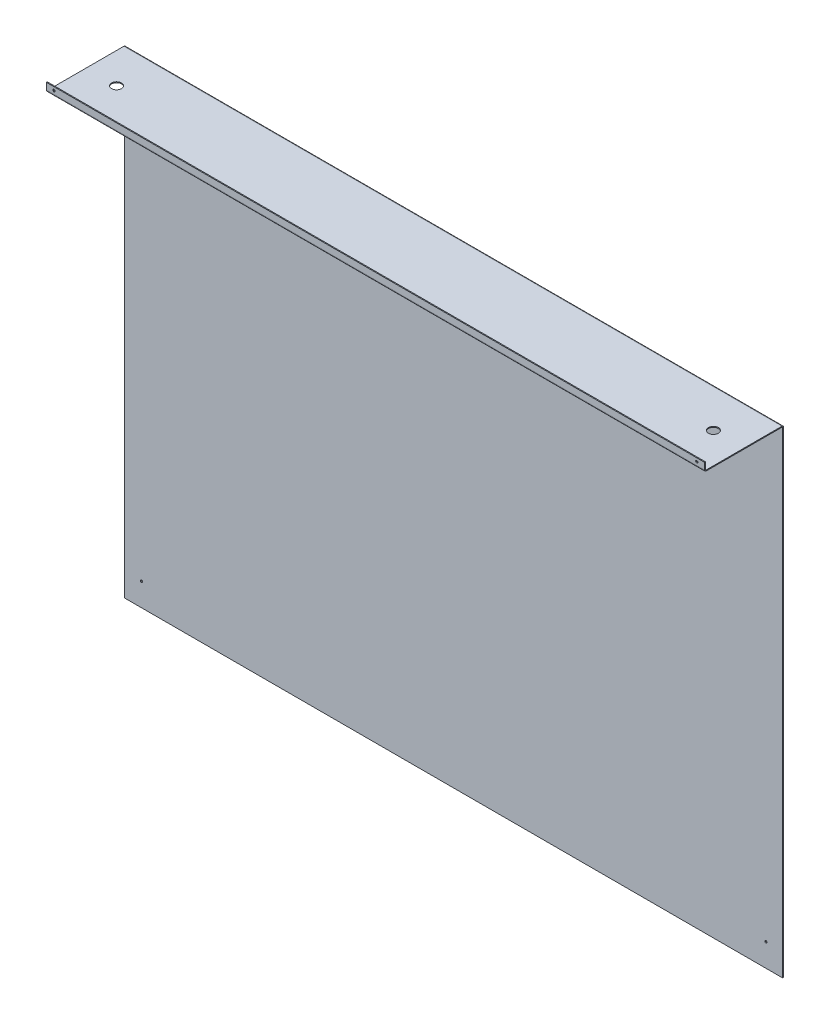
ISO-10303-21;
HEADER;
FILE_DESCRIPTION(('STEP AP214'),'2;1');
FILE_NAME('part.step','',(''),(''),'','','');
FILE_SCHEMA(('AUTOMOTIVE_DESIGN { 1 0 10303 214 1 1 1 1 }'));
ENDSEC;
DATA;
#1=APPLICATION_CONTEXT('core data for automotive mechanical design processes');
#2=APPLICATION_PROTOCOL_DEFINITION('international standard','automotive_design',2000,#1);
#3=PRODUCT_CONTEXT('',#1,'mechanical');
#4=PRODUCT('Part','Part','',(#3));
#5=PRODUCT_RELATED_PRODUCT_CATEGORY('part','',(#4));
#6=PRODUCT_DEFINITION_FORMATION('','',#4);
#7=PRODUCT_DEFINITION_CONTEXT('part definition',#1,'design');
#8=PRODUCT_DEFINITION('design','',#6,#7);
#9=PRODUCT_DEFINITION_SHAPE('','',#8);
#10=(LENGTH_UNIT() NAMED_UNIT(*) SI_UNIT(.MILLI.,.METRE.));
#11=(NAMED_UNIT(*) PLANE_ANGLE_UNIT() SI_UNIT($,.RADIAN.));
#12=(NAMED_UNIT(*) SI_UNIT($,.STERADIAN.) SOLID_ANGLE_UNIT());
#13=UNCERTAINTY_MEASURE_WITH_UNIT(LENGTH_MEASURE(1.E-05),#10,'distance_accuracy_value','');
#14=(GEOMETRIC_REPRESENTATION_CONTEXT(3) GLOBAL_UNCERTAINTY_ASSIGNED_CONTEXT((#13)) GLOBAL_UNIT_ASSIGNED_CONTEXT((#10,
#11,#12)) REPRESENTATION_CONTEXT('',''));
#15=CARTESIAN_POINT('',(0.,0.,0.));
#16=DIRECTION('',(0.,0.,1.));
#17=DIRECTION('',(1.,0.,0.));
#18=AXIS2_PLACEMENT_3D('',#15,#16,#17);
#19=CARTESIAN_POINT('',(430.,275.7,103.5));
#20=DIRECTION('',(1.,0.,0.));
#21=DIRECTION('',(0.,0.,-1.));
#22=AXIS2_PLACEMENT_3D('',#19,#20,#21);
#23=PLANE('',#22);
#24=DIRECTION('',(0.,0.,1.));
#25=VECTOR('',#24,1.);
#26=CARTESIAN_POINT('',(430.,275.7,103.5));
#27=LINE('',#26,#25);
#28=CARTESIAN_POINT('',(430.,275.7,2.19999999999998));
#29=VERTEX_POINT('',#28);
#30=CARTESIAN_POINT('',(430.,275.7,101.3));
#31=VERTEX_POINT('',#30);
#32=EDGE_CURVE('E233',#29,#31,#27,.T.);
#33=ORIENTED_EDGE('',*,*,#32,.T.);
#34=DIRECTION('',(0.,-1.,0.));
#35=VECTOR('',#34,1.);
#36=CARTESIAN_POINT('',(430.,275.7,101.3));
#37=LINE('',#36,#35);
#38=CARTESIAN_POINT('',(430.,274.5,101.3));
#39=VERTEX_POINT('',#38);
#40=EDGE_CURVE('E217',#31,#39,#37,.T.);
#41=ORIENTED_EDGE('',*,*,#40,.T.);
#42=DIRECTION('',(0.,0.,-1.));
#43=VECTOR('',#42,1.);
#44=CARTESIAN_POINT('',(430.,274.5,-1.9762620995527E-13));
#45=LINE('',#44,#43);
#46=CARTESIAN_POINT('',(430.,274.5,2.19999999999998));
#47=VERTEX_POINT('',#46);
#48=EDGE_CURVE('E237',#47,#39,#45,.F.);
#49=ORIENTED_EDGE('',*,*,#48,.F.);
#50=DIRECTION('',(0.,1.,0.));
#51=VECTOR('',#50,1.);
#52=CARTESIAN_POINT('',(430.,275.7,2.19999999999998));
#53=LINE('',#52,#51);
#54=EDGE_CURVE('E228',#47,#29,#53,.T.);
#55=ORIENTED_EDGE('',*,*,#54,.T.);
#56=EDGE_LOOP('',(#33,#41,#49,#55));
#57=FACE_BOUND('',#56,.T.);
#58=ADVANCED_FACE('F77',(#57),#23,.T.);
#59=CARTESIAN_POINT('',(0.,275.7,-9.01809976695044E-13));
#60=DIRECTION('',(0.,1.,0.));
#61=DIRECTION('',(0.,0.,1.));
#62=AXIS2_PLACEMENT_3D('',#59,#60,#61);
#63=PLANE('',#62);
#64=CARTESIAN_POINT('',(390.,275.7,51.7499999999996));
#65=DIRECTION('',(0.,1.,0.));
#66=DIRECTION('',(0.,0.,1.));
#67=AXIS2_PLACEMENT_3D('',#64,#65,#66);
#68=CIRCLE('',#67,6.50000000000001);
#69=CARTESIAN_POINT('',(390.,275.7,58.2499999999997));
#70=VERTEX_POINT('',#69);
#71=EDGE_CURVE('E438',#70,#70,#68,.T.);
#72=ORIENTED_EDGE('',*,*,#71,.F.);
#73=EDGE_LOOP('',(#72));
#74=FACE_BOUND('',#73,.T.);
#75=CARTESIAN_POINT('',(-390.,275.7,51.7499999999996));
#76=DIRECTION('',(0.,1.,0.));
#77=DIRECTION('',(0.,0.,1.));
#78=AXIS2_PLACEMENT_3D('',#75,#76,#77);
#79=CIRCLE('',#78,6.50000000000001);
#80=CARTESIAN_POINT('',(-390.,275.7,58.2499999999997));
#81=VERTEX_POINT('',#80);
#82=EDGE_CURVE('E424',#81,#81,#79,.T.);
#83=ORIENTED_EDGE('',*,*,#82,.F.);
#84=EDGE_LOOP('',(#83));
#85=FACE_BOUND('',#84,.T.);
#86=DIRECTION('',(0.,0.,-1.));
#87=VECTOR('',#86,1.);
#88=CARTESIAN_POINT('',(-430.,275.7,1.2));
#89=LINE('',#88,#87);
#90=CARTESIAN_POINT('',(-430.,275.7,101.3));
#91=VERTEX_POINT('',#90);
#92=CARTESIAN_POINT('',(-430.,275.7,2.19999999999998));
#93=VERTEX_POINT('',#92);
#94=EDGE_CURVE('E230',#91,#93,#89,.T.);
#95=ORIENTED_EDGE('',*,*,#94,.F.);
#96=DIRECTION('',(1.,0.,0.));
#97=VECTOR('',#96,1.);
#98=CARTESIAN_POINT('',(430.,275.7,101.3));
#99=LINE('',#98,#97);
#100=EDGE_CURVE('E99',#31,#91,#99,.F.);
#101=ORIENTED_EDGE('',*,*,#100,.F.);
#102=ORIENTED_EDGE('',*,*,#32,.F.);
#103=DIRECTION('',(-1.,0.,0.));
#104=VECTOR('',#103,1.);
#105=CARTESIAN_POINT('',(0.,275.7,2.19999999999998));
#106=LINE('',#105,#104);
#107=EDGE_CURVE('E240',#29,#93,#106,.T.);
#108=ORIENTED_EDGE('',*,*,#107,.T.);
#109=EDGE_LOOP('',(#95,#101,#102,#108));
#110=FACE_BOUND('',#109,.T.);
#111=ADVANCED_FACE('F325',(#74,#85,#110),#63,.T.);
#112=CARTESIAN_POINT('',(0.,274.5,-8.97620199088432E-13));
#113=DIRECTION('',(0.,1.,0.));
#114=DIRECTION('',(0.,0.,1.));
#115=AXIS2_PLACEMENT_3D('',#112,#113,#114);
#116=PLANE('',#115);
#117=CARTESIAN_POINT('',(390.,274.5,51.7499999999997));
#118=DIRECTION('',(0.,1.,0.));
#119=DIRECTION('',(0.,0.,1.));
#120=AXIS2_PLACEMENT_3D('',#117,#118,#119);
#121=CIRCLE('',#120,6.50000000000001);
#122=CARTESIAN_POINT('',(390.,274.5,58.2499999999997));
#123=VERTEX_POINT('',#122);
#124=EDGE_CURVE('E435',#123,#123,#121,.T.);
#125=ORIENTED_EDGE('',*,*,#124,.T.);
#126=EDGE_LOOP('',(#125));
#127=FACE_BOUND('',#126,.T.);
#128=CARTESIAN_POINT('',(-390.,274.5,51.7499999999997));
#129=DIRECTION('',(0.,1.,0.));
#130=DIRECTION('',(0.,0.,1.));
#131=AXIS2_PLACEMENT_3D('',#128,#129,#130);
#132=CIRCLE('',#131,6.50000000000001);
#133=CARTESIAN_POINT('',(-390.,274.5,58.2499999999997));
#134=VERTEX_POINT('',#133);
#135=EDGE_CURVE('E428',#134,#134,#132,.T.);
#136=ORIENTED_EDGE('',*,*,#135,.T.);
#137=EDGE_LOOP('',(#136));
#138=FACE_BOUND('',#137,.T.);
#139=DIRECTION('',(1.,0.,0.));
#140=VECTOR('',#139,1.);
#141=CARTESIAN_POINT('',(430.,274.5,101.3));
#142=LINE('',#141,#140);
#143=CARTESIAN_POINT('',(-430.,274.5,101.3));
#144=VERTEX_POINT('',#143);
#145=EDGE_CURVE('E211',#39,#144,#142,.F.);
#146=ORIENTED_EDGE('',*,*,#145,.T.);
#147=DIRECTION('',(0.,0.,1.));
#148=VECTOR('',#147,1.);
#149=CARTESIAN_POINT('',(-430.,274.5,-1.83094551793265E-12));
#150=LINE('',#149,#148);
#151=CARTESIAN_POINT('',(-430.,274.5,2.19999999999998));
#152=VERTEX_POINT('',#151);
#153=EDGE_CURVE('E235',#144,#152,#150,.F.);
#154=ORIENTED_EDGE('',*,*,#153,.T.);
#155=DIRECTION('',(1.,0.,0.));
#156=VECTOR('',#155,1.);
#157=CARTESIAN_POINT('',(430.,274.5,2.19999999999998));
#158=LINE('',#157,#156);
#159=EDGE_CURVE('E246',#47,#152,#158,.F.);
#160=ORIENTED_EDGE('',*,*,#159,.F.);
#161=ORIENTED_EDGE('',*,*,#48,.T.);
#162=EDGE_LOOP('',(#146,#154,#160,#161));
#163=FACE_BOUND('',#162,.T.);
#164=ADVANCED_FACE('F331',(#127,#138,#163),#116,.F.);
#165=CARTESIAN_POINT('',(-430.,275.7,1.2));
#166=DIRECTION('',(1.,0.,0.));
#167=DIRECTION('',(0.,1.,0.));
#168=AXIS2_PLACEMENT_3D('',#165,#166,#167);
#169=PLANE('',#168);
#170=DIRECTION('',(0.,0.,-1.));
#171=VECTOR('',#170,1.);
#172=CARTESIAN_POINT('',(-430.,273.5,1.19999999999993));
#173=LINE('',#172,#171);
#174=CARTESIAN_POINT('',(-430.,273.5,1.19999999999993));
#175=VERTEX_POINT('',#174);
#176=CARTESIAN_POINT('',(-430.,273.5,0.));
#177=VERTEX_POINT('',#176);
#178=EDGE_CURVE('E258',#175,#177,#173,.T.);
#179=ORIENTED_EDGE('',*,*,#178,.T.);
#180=DIRECTION('',(0.,-1.,0.));
#181=VECTOR('',#180,1.);
#182=CARTESIAN_POINT('',(-430.,275.7,0.));
#183=LINE('',#182,#181);
#184=CARTESIAN_POINT('',(-430.,-349.300000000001,0.));
#185=VERTEX_POINT('',#184);
#186=EDGE_CURVE('E271',#177,#185,#183,.T.);
#187=ORIENTED_EDGE('',*,*,#186,.T.);
#188=DIRECTION('',(0.,0.,-1.));
#189=VECTOR('',#188,1.);
#190=CARTESIAN_POINT('',(-430.,-349.300000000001,1.2));
#191=LINE('',#190,#189);
#192=CARTESIAN_POINT('',(-430.,-349.300000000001,1.2));
#193=VERTEX_POINT('',#192);
#194=EDGE_CURVE('E13',#193,#185,#191,.T.);
#195=ORIENTED_EDGE('',*,*,#194,.F.);
#196=DIRECTION('',(0.,-1.,0.));
#197=VECTOR('',#196,1.);
#198=CARTESIAN_POINT('',(-430.,275.7,1.2));
#199=LINE('',#198,#197);
#200=EDGE_CURVE('E274',#175,#193,#199,.T.);
#201=ORIENTED_EDGE('',*,*,#200,.F.);
#202=EDGE_LOOP('',(#179,#187,#195,#201));
#203=FACE_BOUND('',#202,.T.);
#204=ADVANCED_FACE('F79',(#203),#169,.F.);
#205=CARTESIAN_POINT('',(430.,275.7,1.2));
#206=DIRECTION('',(-1.,0.,0.));
#207=DIRECTION('',(0.,-1.,0.));
#208=AXIS2_PLACEMENT_3D('',#205,#206,#207);
#209=PLANE('',#208);
#210=DIRECTION('',(0.,0.,-1.));
#211=VECTOR('',#210,1.);
#212=CARTESIAN_POINT('',(430.,273.5,1.19999999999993));
#213=LINE('',#212,#211);
#214=CARTESIAN_POINT('',(430.,273.5,1.19999999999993));
#215=VERTEX_POINT('',#214);
#216=CARTESIAN_POINT('',(430.,273.5,0.));
#217=VERTEX_POINT('',#216);
#218=EDGE_CURVE('E268',#215,#217,#213,.T.);
#219=ORIENTED_EDGE('',*,*,#218,.F.);
#220=DIRECTION('',(0.,1.,0.));
#221=VECTOR('',#220,1.);
#222=CARTESIAN_POINT('',(430.,275.7,1.2));
#223=LINE('',#222,#221);
#224=CARTESIAN_POINT('',(430.,-349.300000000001,1.2));
#225=VERTEX_POINT('',#224);
#226=EDGE_CURVE('E279',#225,#215,#223,.T.);
#227=ORIENTED_EDGE('',*,*,#226,.F.);
#228=DIRECTION('',(0.,0.,-1.));
#229=VECTOR('',#228,1.);
#230=CARTESIAN_POINT('',(430.,-349.300000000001,1.2));
#231=LINE('',#230,#229);
#232=CARTESIAN_POINT('',(430.,-349.300000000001,0.));
#233=VERTEX_POINT('',#232);
#234=EDGE_CURVE('E85',#225,#233,#231,.T.);
#235=ORIENTED_EDGE('',*,*,#234,.T.);
#236=DIRECTION('',(0.,1.,0.));
#237=VECTOR('',#236,1.);
#238=CARTESIAN_POINT('',(430.,275.7,0.));
#239=LINE('',#238,#237);
#240=EDGE_CURVE('E277',#233,#217,#239,.T.);
#241=ORIENTED_EDGE('',*,*,#240,.T.);
#242=EDGE_LOOP('',(#219,#227,#235,#241));
#243=FACE_BOUND('',#242,.T.);
#244=ADVANCED_FACE('F292',(#243),#209,.F.);
#245=CARTESIAN_POINT('',(0.,0.,1.2));
#246=DIRECTION('',(0.,0.,-1.));
#247=DIRECTION('',(-1.,0.,0.));
#248=AXIS2_PLACEMENT_3D('',#245,#246,#247);
#249=PLANE('',#248);
#250=CARTESIAN_POINT('',(-408.,-319.3,1.2));
#251=DIRECTION('',(0.,0.,-1.));
#252=DIRECTION('',(-1.,0.,0.));
#253=AXIS2_PLACEMENT_3D('',#250,#251,#252);
#254=CIRCLE('',#253,1.50000000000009);
#255=CARTESIAN_POINT('',(-409.5,-319.3,1.2));
#256=VERTEX_POINT('',#255);
#257=EDGE_CURVE('E423',#256,#256,#254,.T.);
#258=ORIENTED_EDGE('',*,*,#257,.T.);
#259=EDGE_LOOP('',(#258));
#260=FACE_BOUND('',#259,.T.);
#261=CARTESIAN_POINT('',(408.,-319.3,1.2));
#262=DIRECTION('',(0.,0.,-1.));
#263=DIRECTION('',(-1.,0.,0.));
#264=AXIS2_PLACEMENT_3D('',#261,#262,#263);
#265=CIRCLE('',#264,1.50000000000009);
#266=CARTESIAN_POINT('',(406.5,-319.3,1.2));
#267=VERTEX_POINT('',#266);
#268=EDGE_CURVE('E425',#267,#267,#265,.T.);
#269=ORIENTED_EDGE('',*,*,#268,.T.);
#270=EDGE_LOOP('',(#269));
#271=FACE_BOUND('',#270,.T.);
#272=DIRECTION('',(-1.,0.,0.));
#273=VECTOR('',#272,1.);
#274=CARTESIAN_POINT('',(-430.,273.5,1.19999999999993));
#275=LINE('',#274,#273);
#276=EDGE_CURVE('E264',#175,#215,#275,.F.);
#277=ORIENTED_EDGE('',*,*,#276,.F.);
#278=ORIENTED_EDGE('',*,*,#200,.T.);
#279=DIRECTION('',(1.,0.,0.));
#280=VECTOR('',#279,1.);
#281=CARTESIAN_POINT('',(430.,-349.300000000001,1.2));
#282=LINE('',#281,#280);
#283=EDGE_CURVE('E276',#193,#225,#282,.T.);
#284=ORIENTED_EDGE('',*,*,#283,.T.);
#285=ORIENTED_EDGE('',*,*,#226,.T.);
#286=EDGE_LOOP('',(#277,#278,#284,#285));
#287=FACE_BOUND('',#286,.T.);
#288=ADVANCED_FACE('F311',(#260,#271,#287),#249,.F.);
#289=CARTESIAN_POINT('',(0.,0.,0.));
#290=DIRECTION('',(0.,0.,-1.));
#291=DIRECTION('',(-1.,0.,0.));
#292=AXIS2_PLACEMENT_3D('',#289,#290,#291);
#293=PLANE('',#292);
#294=CARTESIAN_POINT('',(-408.,-319.3,0.));
#295=DIRECTION('',(0.,0.,1.));
#296=DIRECTION('',(1.,0.,0.));
#297=AXIS2_PLACEMENT_3D('',#294,#295,#296);
#298=CIRCLE('',#297,1.50000000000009);
#299=CARTESIAN_POINT('',(-406.5,-319.3,0.));
#300=VERTEX_POINT('',#299);
#301=EDGE_CURVE('E420',#300,#300,#298,.T.);
#302=ORIENTED_EDGE('',*,*,#301,.T.);
#303=EDGE_LOOP('',(#302));
#304=FACE_BOUND('',#303,.T.);
#305=CARTESIAN_POINT('',(408.,-319.3,0.));
#306=DIRECTION('',(0.,0.,1.));
#307=DIRECTION('',(1.,0.,0.));
#308=AXIS2_PLACEMENT_3D('',#305,#306,#307);
#309=CIRCLE('',#308,1.50000000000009);
#310=CARTESIAN_POINT('',(409.5,-319.3,0.));
#311=VERTEX_POINT('',#310);
#312=EDGE_CURVE('E431',#311,#311,#309,.T.);
#313=ORIENTED_EDGE('',*,*,#312,.T.);
#314=EDGE_LOOP('',(#313));
#315=FACE_BOUND('',#314,.T.);
#316=ORIENTED_EDGE('',*,*,#186,.F.);
#317=DIRECTION('',(-1.,0.,0.));
#318=VECTOR('',#317,1.);
#319=CARTESIAN_POINT('',(-430.,273.5,0.));
#320=LINE('',#319,#318);
#321=EDGE_CURVE('E251',#177,#217,#320,.F.);
#322=ORIENTED_EDGE('',*,*,#321,.T.);
#323=ORIENTED_EDGE('',*,*,#240,.F.);
#324=DIRECTION('',(1.,0.,0.));
#325=VECTOR('',#324,1.);
#326=CARTESIAN_POINT('',(430.,-349.300000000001,0.));
#327=LINE('',#326,#325);
#328=EDGE_CURVE('E283',#185,#233,#327,.T.);
#329=ORIENTED_EDGE('',*,*,#328,.F.);
#330=EDGE_LOOP('',(#316,#322,#323,#329));
#331=FACE_BOUND('',#330,.T.);
#332=ADVANCED_FACE('F298',(#304,#315,#331),#293,.T.);
#333=CARTESIAN_POINT('',(430.,-349.300000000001,1.2));
#334=DIRECTION('',(0.,1.,0.));
#335=DIRECTION('',(-1.,0.,0.));
#336=AXIS2_PLACEMENT_3D('',#333,#334,#335);
#337=PLANE('',#336);
#338=ORIENTED_EDGE('',*,*,#328,.T.);
#339=ORIENTED_EDGE('',*,*,#234,.F.);
#340=ORIENTED_EDGE('',*,*,#283,.F.);
#341=ORIENTED_EDGE('',*,*,#194,.T.);
#342=EDGE_LOOP('',(#338,#339,#340,#341));
#343=FACE_BOUND('',#342,.T.);
#344=ADVANCED_FACE('F312',(#343),#337,.F.);
#345=CARTESIAN_POINT('',(430.,273.5,2.19999999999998));
#346=DIRECTION('',(1.,0.,0.));
#347=DIRECTION('',(0.,0.,-1.));
#348=AXIS2_PLACEMENT_3D('',#345,#346,#347);
#349=PLANE('',#348);
#350=ORIENTED_EDGE('',*,*,#54,.F.);
#351=CARTESIAN_POINT('',(430.,273.5,2.19999999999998));
#352=DIRECTION('',(-1.,0.,0.));
#353=DIRECTION('',(0.,0.,1.));
#354=AXIS2_PLACEMENT_3D('',#351,#352,#353);
#355=CIRCLE('',#354,1.00000000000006);
#356=EDGE_CURVE('E261',#215,#47,#355,.F.);
#357=ORIENTED_EDGE('',*,*,#356,.F.);
#358=ORIENTED_EDGE('',*,*,#218,.T.);
#359=CARTESIAN_POINT('',(430.,273.5,2.19999999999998));
#360=DIRECTION('',(-1.,0.,0.));
#361=DIRECTION('',(0.,0.,1.));
#362=AXIS2_PLACEMENT_3D('',#359,#360,#361);
#363=CIRCLE('',#362,2.20000000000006);
#364=EDGE_CURVE('E254',#217,#29,#363,.F.);
#365=ORIENTED_EDGE('',*,*,#364,.T.);
#366=EDGE_LOOP('',(#350,#357,#358,#365));
#367=FACE_BOUND('',#366,.T.);
#368=ADVANCED_FACE('F314',(#367),#349,.T.);
#369=CARTESIAN_POINT('',(-430.,273.5,2.19999999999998));
#370=DIRECTION('',(1.,0.,0.));
#371=DIRECTION('',(0.,0.,-1.));
#372=AXIS2_PLACEMENT_3D('',#369,#370,#371);
#373=PLANE('',#372);
#374=CARTESIAN_POINT('',(-430.,273.5,2.19999999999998));
#375=DIRECTION('',(-1.,0.,0.));
#376=DIRECTION('',(0.,0.,1.));
#377=AXIS2_PLACEMENT_3D('',#374,#375,#376);
#378=CIRCLE('',#377,1.00000000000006);
#379=EDGE_CURVE('E232',#152,#175,#378,.T.);
#380=ORIENTED_EDGE('',*,*,#379,.F.);
#381=DIRECTION('',(0.,1.,0.));
#382=VECTOR('',#381,1.);
#383=CARTESIAN_POINT('',(-430.,274.5,2.19999999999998));
#384=LINE('',#383,#382);
#385=EDGE_CURVE('E243',#152,#93,#384,.T.);
#386=ORIENTED_EDGE('',*,*,#385,.T.);
#387=CARTESIAN_POINT('',(-430.,273.5,2.19999999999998));
#388=DIRECTION('',(-1.,0.,0.));
#389=DIRECTION('',(0.,0.,1.));
#390=AXIS2_PLACEMENT_3D('',#387,#388,#389);
#391=CIRCLE('',#390,2.20000000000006);
#392=EDGE_CURVE('E255',#93,#177,#391,.T.);
#393=ORIENTED_EDGE('',*,*,#392,.T.);
#394=ORIENTED_EDGE('',*,*,#178,.F.);
#395=EDGE_LOOP('',(#380,#386,#393,#394));
#396=FACE_BOUND('',#395,.T.);
#397=ADVANCED_FACE('F304',(#396),#373,.F.);
#398=CARTESIAN_POINT('',(-430.,273.5,2.19999999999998));
#399=DIRECTION('',(-1.,0.,0.));
#400=DIRECTION('',(0.,1.,0.));
#401=AXIS2_PLACEMENT_3D('',#398,#399,#400);
#402=CYLINDRICAL_SURFACE('',#401,2.20000000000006);
#403=ORIENTED_EDGE('',*,*,#321,.F.);
#404=ORIENTED_EDGE('',*,*,#392,.F.);
#405=ORIENTED_EDGE('',*,*,#107,.F.);
#406=ORIENTED_EDGE('',*,*,#364,.F.);
#407=EDGE_LOOP('',(#403,#404,#405,#406));
#408=FACE_BOUND('',#407,.T.);
#409=ADVANCED_FACE('F301',(#408),#402,.T.);
#410=CARTESIAN_POINT('',(-430.,273.5,2.19999999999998));
#411=DIRECTION('',(-1.,0.,0.));
#412=DIRECTION('',(0.,1.,0.));
#413=AXIS2_PLACEMENT_3D('',#410,#411,#412);
#414=CYLINDRICAL_SURFACE('',#413,1.00000000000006);
#415=ORIENTED_EDGE('',*,*,#276,.T.);
#416=ORIENTED_EDGE('',*,*,#356,.T.);
#417=ORIENTED_EDGE('',*,*,#159,.T.);
#418=ORIENTED_EDGE('',*,*,#379,.T.);
#419=EDGE_LOOP('',(#415,#416,#417,#418));
#420=FACE_BOUND('',#419,.T.);
#421=ADVANCED_FACE('F340',(#420),#414,.F.);
#422=CARTESIAN_POINT('',(-430.,275.7,1.2));
#423=DIRECTION('',(-1.,0.,0.));
#424=DIRECTION('',(0.,0.,1.));
#425=AXIS2_PLACEMENT_3D('',#422,#423,#424);
#426=PLANE('',#425);
#427=DIRECTION('',(0.,-1.,0.));
#428=VECTOR('',#427,1.);
#429=CARTESIAN_POINT('',(-430.,275.7,101.3));
#430=LINE('',#429,#428);
#431=EDGE_CURVE('E92',#91,#144,#430,.T.);
#432=ORIENTED_EDGE('',*,*,#431,.F.);
#433=ORIENTED_EDGE('',*,*,#94,.T.);
#434=ORIENTED_EDGE('',*,*,#385,.F.);
#435=ORIENTED_EDGE('',*,*,#153,.F.);
#436=EDGE_LOOP('',(#432,#433,#434,#435));
#437=FACE_BOUND('',#436,.T.);
#438=ADVANCED_FACE('F336',(#437),#426,.T.);
#439=CARTESIAN_POINT('',(-430.,276.7,101.3));
#440=DIRECTION('',(-1.,0.,0.));
#441=DIRECTION('',(0.,0.,1.));
#442=AXIS2_PLACEMENT_3D('',#439,#440,#441);
#443=PLANE('',#442);
#444=DIRECTION('',(0.,0.,-1.));
#445=VECTOR('',#444,1.);
#446=CARTESIAN_POINT('',(-430.,276.7,103.5));
#447=LINE('',#446,#445);
#448=CARTESIAN_POINT('',(-430.,276.7,102.3));
#449=VERTEX_POINT('',#448);
#450=CARTESIAN_POINT('',(-430.,276.7,103.5));
#451=VERTEX_POINT('',#450);
#452=EDGE_CURVE('E192',#449,#451,#447,.F.);
#453=ORIENTED_EDGE('',*,*,#452,.F.);
#454=CARTESIAN_POINT('',(-430.,276.7,101.3));
#455=DIRECTION('',(1.,0.,0.));
#456=DIRECTION('',(0.,0.,-1.));
#457=AXIS2_PLACEMENT_3D('',#454,#455,#456);
#458=CIRCLE('',#457,1.);
#459=EDGE_CURVE('E220',#91,#449,#458,.F.);
#460=ORIENTED_EDGE('',*,*,#459,.F.);
#461=ORIENTED_EDGE('',*,*,#431,.T.);
#462=CARTESIAN_POINT('',(-430.,276.7,101.3));
#463=DIRECTION('',(1.,0.,0.));
#464=DIRECTION('',(0.,0.,-1.));
#465=AXIS2_PLACEMENT_3D('',#462,#463,#464);
#466=CIRCLE('',#465,2.2);
#467=EDGE_CURVE('E213',#144,#451,#466,.F.);
#468=ORIENTED_EDGE('',*,*,#467,.T.);
#469=EDGE_LOOP('',(#453,#460,#461,#468));
#470=FACE_BOUND('',#469,.T.);
#471=ADVANCED_FACE('F365',(#470),#443,.T.);
#472=CARTESIAN_POINT('',(430.,276.7,101.3));
#473=DIRECTION('',(-1.,0.,0.));
#474=DIRECTION('',(0.,0.,1.));
#475=AXIS2_PLACEMENT_3D('',#472,#473,#474);
#476=PLANE('',#475);
#477=CARTESIAN_POINT('',(430.,276.7,101.3));
#478=DIRECTION('',(1.,0.,0.));
#479=DIRECTION('',(0.,0.,-1.));
#480=AXIS2_PLACEMENT_3D('',#477,#478,#479);
#481=CIRCLE('',#480,1.);
#482=CARTESIAN_POINT('',(430.,276.7,102.3));
#483=VERTEX_POINT('',#482);
#484=EDGE_CURVE('E224',#483,#31,#481,.T.);
#485=ORIENTED_EDGE('',*,*,#484,.F.);
#486=DIRECTION('',(0.,0.,-1.));
#487=VECTOR('',#486,1.);
#488=CARTESIAN_POINT('',(430.,276.7,102.3));
#489=LINE('',#488,#487);
#490=CARTESIAN_POINT('',(430.,276.7,103.5));
#491=VERTEX_POINT('',#490);
#492=EDGE_CURVE('E204',#483,#491,#489,.F.);
#493=ORIENTED_EDGE('',*,*,#492,.T.);
#494=CARTESIAN_POINT('',(430.,276.7,101.3));
#495=DIRECTION('',(1.,0.,0.));
#496=DIRECTION('',(0.,0.,-1.));
#497=AXIS2_PLACEMENT_3D('',#494,#495,#496);
#498=CIRCLE('',#497,2.2);
#499=EDGE_CURVE('E214',#491,#39,#498,.T.);
#500=ORIENTED_EDGE('',*,*,#499,.T.);
#501=ORIENTED_EDGE('',*,*,#40,.F.);
#502=EDGE_LOOP('',(#485,#493,#500,#501));
#503=FACE_BOUND('',#502,.T.);
#504=ADVANCED_FACE('F361',(#503),#476,.F.);
#505=CARTESIAN_POINT('',(430.,276.7,101.3));
#506=DIRECTION('',(1.,0.,0.));
#507=DIRECTION('',(0.,0.,1.));
#508=AXIS2_PLACEMENT_3D('',#505,#506,#507);
#509=CYLINDRICAL_SURFACE('',#508,2.2);
#510=ORIENTED_EDGE('',*,*,#145,.F.);
#511=ORIENTED_EDGE('',*,*,#499,.F.);
#512=DIRECTION('',(1.,0.,0.));
#513=VECTOR('',#512,1.);
#514=CARTESIAN_POINT('',(-430.,276.7,103.5));
#515=LINE('',#514,#513);
#516=EDGE_CURVE('E202',#491,#451,#515,.F.);
#517=ORIENTED_EDGE('',*,*,#516,.T.);
#518=ORIENTED_EDGE('',*,*,#467,.F.);
#519=EDGE_LOOP('',(#510,#511,#517,#518));
#520=FACE_BOUND('',#519,.T.);
#521=ADVANCED_FACE('F364',(#520),#509,.T.);
#522=CARTESIAN_POINT('',(430.,276.7,101.3));
#523=DIRECTION('',(1.,0.,0.));
#524=DIRECTION('',(0.,0.,1.));
#525=AXIS2_PLACEMENT_3D('',#522,#523,#524);
#526=CYLINDRICAL_SURFACE('',#525,1.);
#527=ORIENTED_EDGE('',*,*,#100,.T.);
#528=ORIENTED_EDGE('',*,*,#459,.T.);
#529=DIRECTION('',(1.,0.,0.));
#530=VECTOR('',#529,1.);
#531=CARTESIAN_POINT('',(-430.,276.7,102.3));
#532=LINE('',#531,#530);
#533=EDGE_CURVE('E207',#449,#483,#532,.T.);
#534=ORIENTED_EDGE('',*,*,#533,.T.);
#535=ORIENTED_EDGE('',*,*,#484,.T.);
#536=EDGE_LOOP('',(#527,#528,#534,#535));
#537=FACE_BOUND('',#536,.T.);
#538=ADVANCED_FACE('F370',(#537),#526,.F.);
#539=CARTESIAN_POINT('',(430.,285.5,103.5));
#540=DIRECTION('',(-1.,0.,0.));
#541=DIRECTION('',(0.,0.,1.));
#542=AXIS2_PLACEMENT_3D('',#539,#540,#541);
#543=PLANE('',#542);
#544=ORIENTED_EDGE('',*,*,#492,.F.);
#545=DIRECTION('',(0.,-1.,0.));
#546=VECTOR('',#545,1.);
#547=CARTESIAN_POINT('',(430.,285.5,102.3));
#548=LINE('',#547,#546);
#549=CARTESIAN_POINT('',(430.,285.5,102.3));
#550=VERTEX_POINT('',#549);
#551=EDGE_CURVE('E200',#483,#550,#548,.F.);
#552=ORIENTED_EDGE('',*,*,#551,.T.);
#553=DIRECTION('',(0.,0.,-1.));
#554=VECTOR('',#553,1.);
#555=CARTESIAN_POINT('',(430.,285.5,103.5));
#556=LINE('',#555,#554);
#557=CARTESIAN_POINT('',(430.,285.5,103.5));
#558=VERTEX_POINT('',#557);
#559=EDGE_CURVE('E188',#558,#550,#556,.T.);
#560=ORIENTED_EDGE('',*,*,#559,.F.);
#561=DIRECTION('',(0.,1.,0.));
#562=VECTOR('',#561,1.);
#563=CARTESIAN_POINT('',(430.,0.,103.5));
#564=LINE('',#563,#562);
#565=EDGE_CURVE('E175',#491,#558,#564,.T.);
#566=ORIENTED_EDGE('',*,*,#565,.F.);
#567=EDGE_LOOP('',(#544,#552,#560,#566));
#568=FACE_BOUND('',#567,.T.);
#569=ADVANCED_FACE('F373',(#568),#543,.F.);
#570=CARTESIAN_POINT('',(-430.,275.7,103.5));
#571=DIRECTION('',(1.,0.,0.));
#572=DIRECTION('',(0.,0.,-1.));
#573=AXIS2_PLACEMENT_3D('',#570,#571,#572);
#574=PLANE('',#573);
#575=ORIENTED_EDGE('',*,*,#452,.T.);
#576=DIRECTION('',(0.,-1.,0.));
#577=VECTOR('',#576,1.);
#578=CARTESIAN_POINT('',(-430.,0.,103.5));
#579=LINE('',#578,#577);
#580=CARTESIAN_POINT('',(-430.,285.5,103.5));
#581=VERTEX_POINT('',#580);
#582=EDGE_CURVE('E173',#581,#451,#579,.T.);
#583=ORIENTED_EDGE('',*,*,#582,.F.);
#584=DIRECTION('',(0.,0.,-1.));
#585=VECTOR('',#584,1.);
#586=CARTESIAN_POINT('',(-430.,285.5,103.5));
#587=LINE('',#586,#585);
#588=CARTESIAN_POINT('',(-430.,285.5,102.3));
#589=VERTEX_POINT('',#588);
#590=EDGE_CURVE('E181',#581,#589,#587,.T.);
#591=ORIENTED_EDGE('',*,*,#590,.T.);
#592=DIRECTION('',(0.,1.,0.));
#593=VECTOR('',#592,1.);
#594=CARTESIAN_POINT('',(-430.,275.7,102.3));
#595=LINE('',#594,#593);
#596=EDGE_CURVE('E197',#589,#449,#595,.F.);
#597=ORIENTED_EDGE('',*,*,#596,.T.);
#598=EDGE_LOOP('',(#575,#583,#591,#597));
#599=FACE_BOUND('',#598,.T.);
#600=ADVANCED_FACE('F191',(#599),#574,.F.);
#601=CARTESIAN_POINT('',(0.,0.,103.5));
#602=DIRECTION('',(0.,0.,-1.));
#603=DIRECTION('',(-1.,0.,0.));
#604=AXIS2_PLACEMENT_3D('',#601,#602,#603);
#605=PLANE('',#604);
#606=CARTESIAN_POINT('',(420.,281.1,103.5));
#607=DIRECTION('',(0.,0.,-1.));
#608=DIRECTION('',(-1.,0.,0.));
#609=AXIS2_PLACEMENT_3D('',#606,#607,#608);
#610=CIRCLE('',#609,1.50000000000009);
#611=CARTESIAN_POINT('',(418.5,281.1,103.5));
#612=VERTEX_POINT('',#611);
#613=EDGE_CURVE('E210',#612,#612,#610,.T.);
#614=ORIENTED_EDGE('',*,*,#613,.T.);
#615=EDGE_LOOP('',(#614));
#616=FACE_BOUND('',#615,.T.);
#617=CARTESIAN_POINT('',(-420.,281.1,103.5));
#618=DIRECTION('',(0.,0.,-1.));
#619=DIRECTION('',(-1.,0.,0.));
#620=AXIS2_PLACEMENT_3D('',#617,#618,#619);
#621=CIRCLE('',#620,1.50000000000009);
#622=CARTESIAN_POINT('',(-421.5,281.1,103.5));
#623=VERTEX_POINT('',#622);
#624=EDGE_CURVE('E448',#623,#623,#621,.T.);
#625=ORIENTED_EDGE('',*,*,#624,.T.);
#626=EDGE_LOOP('',(#625));
#627=FACE_BOUND('',#626,.T.);
#628=ORIENTED_EDGE('',*,*,#516,.F.);
#629=ORIENTED_EDGE('',*,*,#565,.T.);
#630=DIRECTION('',(-1.,0.,0.));
#631=VECTOR('',#630,1.);
#632=CARTESIAN_POINT('',(0.,285.5,103.5));
#633=LINE('',#632,#631);
#634=EDGE_CURVE('E168',#558,#581,#633,.T.);
#635=ORIENTED_EDGE('',*,*,#634,.T.);
#636=ORIENTED_EDGE('',*,*,#582,.T.);
#637=EDGE_LOOP('',(#628,#629,#635,#636));
#638=FACE_BOUND('',#637,.T.);
#639=ADVANCED_FACE('F171',(#616,#627,#638),#605,.F.);
#640=CARTESIAN_POINT('',(0.,0.,102.3));
#641=DIRECTION('',(0.,0.,-1.));
#642=DIRECTION('',(-1.,0.,0.));
#643=AXIS2_PLACEMENT_3D('',#640,#641,#642);
#644=PLANE('',#643);
#645=CARTESIAN_POINT('',(420.,281.1,102.3));
#646=DIRECTION('',(0.,0.,-1.));
#647=DIRECTION('',(-1.,0.,0.));
#648=AXIS2_PLACEMENT_3D('',#645,#646,#647);
#649=CIRCLE('',#648,1.50000000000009);
#650=CARTESIAN_POINT('',(418.5,281.1,102.3));
#651=VERTEX_POINT('',#650);
#652=EDGE_CURVE('E445',#651,#651,#649,.T.);
#653=ORIENTED_EDGE('',*,*,#652,.F.);
#654=EDGE_LOOP('',(#653));
#655=FACE_BOUND('',#654,.T.);
#656=CARTESIAN_POINT('',(-420.,281.1,102.3));
#657=DIRECTION('',(0.,0.,-1.));
#658=DIRECTION('',(-1.,0.,0.));
#659=AXIS2_PLACEMENT_3D('',#656,#657,#658);
#660=CIRCLE('',#659,1.50000000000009);
#661=CARTESIAN_POINT('',(-421.5,281.1,102.3));
#662=VERTEX_POINT('',#661);
#663=EDGE_CURVE('E437',#662,#662,#660,.T.);
#664=ORIENTED_EDGE('',*,*,#663,.F.);
#665=EDGE_LOOP('',(#664));
#666=FACE_BOUND('',#665,.T.);
#667=ORIENTED_EDGE('',*,*,#551,.F.);
#668=ORIENTED_EDGE('',*,*,#533,.F.);
#669=ORIENTED_EDGE('',*,*,#596,.F.);
#670=DIRECTION('',(1.,0.,0.));
#671=VECTOR('',#670,1.);
#672=CARTESIAN_POINT('',(-430.,285.5,102.3));
#673=LINE('',#672,#671);
#674=EDGE_CURVE('E184',#550,#589,#673,.F.);
#675=ORIENTED_EDGE('',*,*,#674,.F.);
#676=EDGE_LOOP('',(#667,#668,#669,#675));
#677=FACE_BOUND('',#676,.T.);
#678=ADVANCED_FACE('F384',(#655,#666,#677),#644,.T.);
#679=CARTESIAN_POINT('',(-430.,285.5,103.5));
#680=DIRECTION('',(0.,-1.,0.));
#681=DIRECTION('',(0.,0.,-1.));
#682=AXIS2_PLACEMENT_3D('',#679,#680,#681);
#683=PLANE('',#682);
#684=ORIENTED_EDGE('',*,*,#674,.T.);
#685=ORIENTED_EDGE('',*,*,#590,.F.);
#686=ORIENTED_EDGE('',*,*,#634,.F.);
#687=ORIENTED_EDGE('',*,*,#559,.T.);
#688=EDGE_LOOP('',(#684,#685,#686,#687));
#689=FACE_BOUND('',#688,.T.);
#690=ADVANCED_FACE('F182',(#689),#683,.F.);
#691=CARTESIAN_POINT('',(-420.,281.1,103.5));
#692=DIRECTION('',(0.,0.,-1.));
#693=DIRECTION('',(-1.,0.,0.));
#694=AXIS2_PLACEMENT_3D('',#691,#692,#693);
#695=CYLINDRICAL_SURFACE('',#694,1.50000000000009);
#696=ORIENTED_EDGE('',*,*,#624,.F.);
#697=EDGE_LOOP('',(#696));
#698=FACE_BOUND('',#697,.T.);
#699=ORIENTED_EDGE('',*,*,#663,.T.);
#700=EDGE_LOOP('',(#699));
#701=FACE_BOUND('',#700,.T.);
#702=ADVANCED_FACE('F383',(#698,#701),#695,.F.);
#703=CARTESIAN_POINT('',(420.,281.1,103.5));
#704=DIRECTION('',(0.,0.,-1.));
#705=DIRECTION('',(-1.,0.,0.));
#706=AXIS2_PLACEMENT_3D('',#703,#704,#705);
#707=CYLINDRICAL_SURFACE('',#706,1.50000000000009);
#708=ORIENTED_EDGE('',*,*,#613,.F.);
#709=EDGE_LOOP('',(#708));
#710=FACE_BOUND('',#709,.T.);
#711=ORIENTED_EDGE('',*,*,#652,.T.);
#712=EDGE_LOOP('',(#711));
#713=FACE_BOUND('',#712,.T.);
#714=ADVANCED_FACE('F395',(#710,#713),#707,.F.);
#715=CARTESIAN_POINT('',(-390.,274.5,51.7499999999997));
#716=DIRECTION('',(0.,1.,0.));
#717=DIRECTION('',(0.,0.,1.));
#718=AXIS2_PLACEMENT_3D('',#715,#716,#717);
#719=CYLINDRICAL_SURFACE('',#718,6.50000000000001);
#720=ORIENTED_EDGE('',*,*,#135,.F.);
#721=EDGE_LOOP('',(#720));
#722=FACE_BOUND('',#721,.T.);
#723=ORIENTED_EDGE('',*,*,#82,.T.);
#724=EDGE_LOOP('',(#723));
#725=FACE_BOUND('',#724,.T.);
#726=ADVANCED_FACE('F399',(#722,#725),#719,.F.);
#727=CARTESIAN_POINT('',(390.,274.5,51.7499999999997));
#728=DIRECTION('',(0.,1.,0.));
#729=DIRECTION('',(0.,0.,1.));
#730=AXIS2_PLACEMENT_3D('',#727,#728,#729);
#731=CYLINDRICAL_SURFACE('',#730,6.50000000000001);
#732=ORIENTED_EDGE('',*,*,#124,.F.);
#733=EDGE_LOOP('',(#732));
#734=FACE_BOUND('',#733,.T.);
#735=ORIENTED_EDGE('',*,*,#71,.T.);
#736=EDGE_LOOP('',(#735));
#737=FACE_BOUND('',#736,.T.);
#738=ADVANCED_FACE('F403',(#734,#737),#731,.F.);
#739=CARTESIAN_POINT('',(408.,-319.3,0.));
#740=DIRECTION('',(0.,0.,1.));
#741=DIRECTION('',(1.,0.,0.));
#742=AXIS2_PLACEMENT_3D('',#739,#740,#741);
#743=CYLINDRICAL_SURFACE('',#742,1.50000000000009);
#744=ORIENTED_EDGE('',*,*,#312,.F.);
#745=EDGE_LOOP('',(#744));
#746=FACE_BOUND('',#745,.T.);
#747=ORIENTED_EDGE('',*,*,#268,.F.);
#748=EDGE_LOOP('',(#747));
#749=FACE_BOUND('',#748,.T.);
#750=ADVANCED_FACE('F407',(#746,#749),#743,.F.);
#751=CARTESIAN_POINT('',(-408.,-319.3,0.));
#752=DIRECTION('',(0.,0.,1.));
#753=DIRECTION('',(1.,0.,0.));
#754=AXIS2_PLACEMENT_3D('',#751,#752,#753);
#755=CYLINDRICAL_SURFACE('',#754,1.50000000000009);
#756=ORIENTED_EDGE('',*,*,#301,.F.);
#757=EDGE_LOOP('',(#756));
#758=FACE_BOUND('',#757,.T.);
#759=ORIENTED_EDGE('',*,*,#257,.F.);
#760=EDGE_LOOP('',(#759));
#761=FACE_BOUND('',#760,.T.);
#762=ADVANCED_FACE('F411',(#758,#761),#755,.F.);
#763=CLOSED_SHELL('',(#58,#111,#164,#204,#244,#288,#332,#344,#368,#397,#409,#421,#438,#471,#504,
#521,#538,#569,#600,#639,#678,#690,#702,#714,#726,#738,#750,#762));
#764=MANIFOLD_SOLID_BREP('B2',#763);
#765=ADVANCED_BREP_SHAPE_REPRESENTATION('',(#18,#764),#14);
#766=SHAPE_DEFINITION_REPRESENTATION(#9,#765);
ENDSEC;
END-ISO-10303-21;
